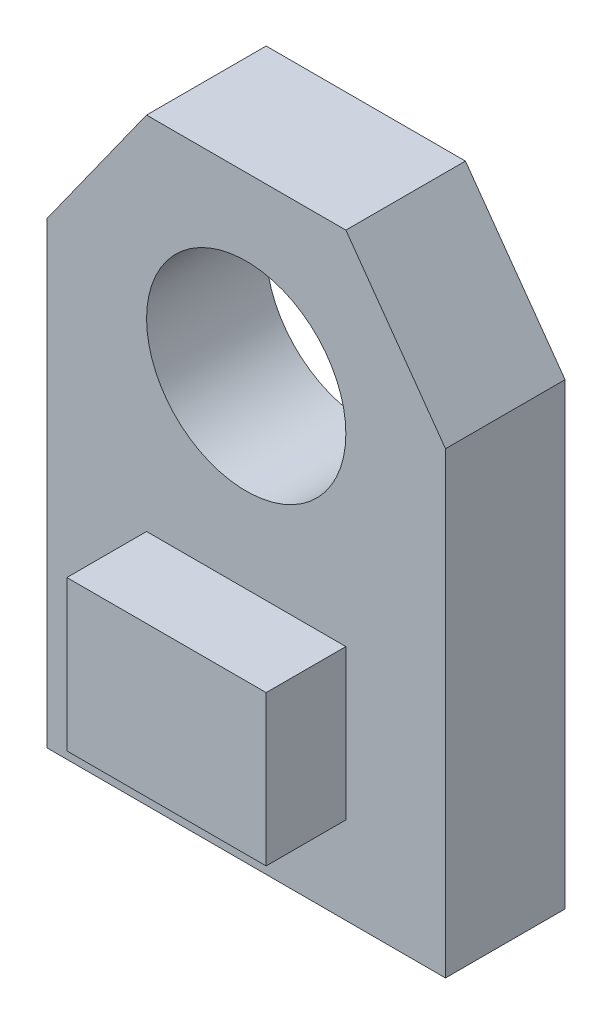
ISO-10303-21;
HEADER;
FILE_DESCRIPTION(('STEP AP214'),'2;1');
FILE_NAME('part.step','',(''),(''),'','','');
FILE_SCHEMA(('AUTOMOTIVE_DESIGN { 1 0 10303 214 1 1 1 1 }'));
ENDSEC;
DATA;
#1=APPLICATION_CONTEXT('core data for automotive mechanical design processes');
#2=APPLICATION_PROTOCOL_DEFINITION('international standard','automotive_design',2000,#1);
#3=PRODUCT_CONTEXT('',#1,'mechanical');
#4=PRODUCT('Part','Part','',(#3));
#5=PRODUCT_RELATED_PRODUCT_CATEGORY('part','',(#4));
#6=PRODUCT_DEFINITION_FORMATION('','',#4);
#7=PRODUCT_DEFINITION_CONTEXT('part definition',#1,'design');
#8=PRODUCT_DEFINITION('design','',#6,#7);
#9=PRODUCT_DEFINITION_SHAPE('','',#8);
#10=(LENGTH_UNIT() NAMED_UNIT(*) SI_UNIT(.MILLI.,.METRE.));
#11=(NAMED_UNIT(*) PLANE_ANGLE_UNIT() SI_UNIT($,.RADIAN.));
#12=(NAMED_UNIT(*) SI_UNIT($,.STERADIAN.) SOLID_ANGLE_UNIT());
#13=UNCERTAINTY_MEASURE_WITH_UNIT(LENGTH_MEASURE(1.E-05),#10,'distance_accuracy_value','');
#14=(GEOMETRIC_REPRESENTATION_CONTEXT(3) GLOBAL_UNCERTAINTY_ASSIGNED_CONTEXT((#13)) GLOBAL_UNIT_ASSIGNED_CONTEXT((#10,
#11,#12)) REPRESENTATION_CONTEXT('',''));
#15=CARTESIAN_POINT('',(0.,0.,0.));
#16=DIRECTION('',(0.,0.,1.));
#17=DIRECTION('',(1.,0.,0.));
#18=AXIS2_PLACEMENT_3D('',#15,#16,#17);
#19=CARTESIAN_POINT('',(0.,74.,12.));
#20=DIRECTION('',(0.,0.,1.));
#21=DIRECTION('',(1.,0.,0.));
#22=AXIS2_PLACEMENT_3D('',#19,#20,#21);
#23=PLANE('',#22);
#24=DIRECTION('',(-0.581238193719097,-0.813733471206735,0.));
#25=VECTOR('',#24,1.);
#26=CARTESIAN_POINT('',(-10.,60.,12.));
#27=LINE('',#26,#25);
#28=CARTESIAN_POINT('',(-10.,60.,12.));
#29=VERTEX_POINT('',#28);
#30=CARTESIAN_POINT('',(-20.,46.,12.));
#31=VERTEX_POINT('',#30);
#32=EDGE_CURVE('E140',#29,#31,#27,.T.);
#33=ORIENTED_EDGE('',*,*,#32,.T.);
#34=DIRECTION('',(0.,-1.,0.));
#35=VECTOR('',#34,1.);
#36=CARTESIAN_POINT('',(-20.,46.,12.));
#37=LINE('',#36,#35);
#38=CARTESIAN_POINT('',(-20.,0.,12.));
#39=VERTEX_POINT('',#38);
#40=EDGE_CURVE('E91',#31,#39,#37,.T.);
#41=ORIENTED_EDGE('',*,*,#40,.T.);
#42=DIRECTION('',(1.,0.,0.));
#43=VECTOR('',#42,1.);
#44=CARTESIAN_POINT('',(-20.,0.,12.));
#45=LINE('',#44,#43);
#46=CARTESIAN_POINT('',(20.,0.,12.));
#47=VERTEX_POINT('',#46);
#48=EDGE_CURVE('E108',#39,#47,#45,.T.);
#49=ORIENTED_EDGE('',*,*,#48,.T.);
#50=DIRECTION('',(0.,1.,0.));
#51=VECTOR('',#50,1.);
#52=CARTESIAN_POINT('',(20.,46.,12.));
#53=LINE('',#52,#51);
#54=CARTESIAN_POINT('',(20.,46.,12.));
#55=VERTEX_POINT('',#54);
#56=EDGE_CURVE('E101',#47,#55,#53,.T.);
#57=ORIENTED_EDGE('',*,*,#56,.T.);
#58=DIRECTION('',(-0.581238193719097,0.813733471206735,0.));
#59=VECTOR('',#58,1.);
#60=CARTESIAN_POINT('',(10.,60.,12.));
#61=LINE('',#60,#59);
#62=CARTESIAN_POINT('',(10.,60.,12.));
#63=VERTEX_POINT('',#62);
#64=EDGE_CURVE('E105',#55,#63,#61,.T.);
#65=ORIENTED_EDGE('',*,*,#64,.T.);
#66=DIRECTION('',(-1.,0.,0.));
#67=VECTOR('',#66,1.);
#68=CARTESIAN_POINT('',(10.,60.,12.));
#69=LINE('',#68,#67);
#70=EDGE_CURVE('E56',#63,#29,#69,.T.);
#71=ORIENTED_EDGE('',*,*,#70,.T.);
#72=EDGE_LOOP('',(#33,#41,#49,#57,#65,#71));
#73=FACE_BOUND('',#72,.T.);
#74=CARTESIAN_POINT('',(0.,42.3114607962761,12.));
#75=DIRECTION('',(0.,0.,1.));
#76=DIRECTION('',(1.,0.,0.));
#77=AXIS2_PLACEMENT_3D('',#74,#75,#76);
#78=CIRCLE('',#77,10.);
#79=CARTESIAN_POINT('',(10.,42.3114607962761,12.));
#80=VERTEX_POINT('',#79);
#81=EDGE_CURVE('E158',#80,#80,#78,.T.);
#82=ORIENTED_EDGE('',*,*,#81,.F.);
#83=EDGE_LOOP('',(#82));
#84=FACE_BOUND('',#83,.T.);
#85=DIRECTION('',(-1.,0.,0.));
#86=VECTOR('',#85,1.);
#87=CARTESIAN_POINT('',(-10.,23.8052365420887,12.));
#88=LINE('',#87,#86);
#89=CARTESIAN_POINT('',(10.,23.8052365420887,12.));
#90=VERTEX_POINT('',#89);
#91=CARTESIAN_POINT('',(-10.,23.8052365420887,12.));
#92=VERTEX_POINT('',#91);
#93=EDGE_CURVE('E177',#90,#92,#88,.T.);
#94=ORIENTED_EDGE('',*,*,#93,.F.);
#95=DIRECTION('',(0.,1.,0.));
#96=VECTOR('',#95,1.);
#97=CARTESIAN_POINT('',(10.,23.8052365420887,12.));
#98=LINE('',#97,#96);
#99=CARTESIAN_POINT('',(10.,8.73732717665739,12.));
#100=VERTEX_POINT('',#99);
#101=EDGE_CURVE('E180',#100,#90,#98,.T.);
#102=ORIENTED_EDGE('',*,*,#101,.F.);
#103=DIRECTION('',(1.,0.,0.));
#104=VECTOR('',#103,1.);
#105=CARTESIAN_POINT('',(10.,8.73732717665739,12.));
#106=LINE('',#105,#104);
#107=CARTESIAN_POINT('',(-10.,8.73732717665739,12.));
#108=VERTEX_POINT('',#107);
#109=EDGE_CURVE('E172',#108,#100,#106,.T.);
#110=ORIENTED_EDGE('',*,*,#109,.F.);
#111=DIRECTION('',(0.,-1.,0.));
#112=VECTOR('',#111,1.);
#113=CARTESIAN_POINT('',(-10.,23.8052365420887,12.));
#114=LINE('',#113,#112);
#115=EDGE_CURVE('E175',#92,#108,#114,.T.);
#116=ORIENTED_EDGE('',*,*,#115,.F.);
#117=EDGE_LOOP('',(#94,#102,#110,#116));
#118=FACE_BOUND('',#117,.T.);
#119=ADVANCED_FACE('F31',(#73,#84,#118),#23,.T.);
#120=CARTESIAN_POINT('',(-10.,60.,12.));
#121=DIRECTION('',(0.813733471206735,-0.581238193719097,0.));
#122=DIRECTION('',(0.581238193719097,0.813733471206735,0.));
#123=AXIS2_PLACEMENT_3D('',#120,#121,#122);
#124=PLANE('',#123);
#125=DIRECTION('',(-0.581238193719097,-0.813733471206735,0.));
#126=VECTOR('',#125,1.);
#127=CARTESIAN_POINT('',(-10.,60.,0.));
#128=LINE('',#127,#126);
#129=CARTESIAN_POINT('',(-10.,60.,0.));
#130=VERTEX_POINT('',#129);
#131=CARTESIAN_POINT('',(-20.,46.,0.));
#132=VERTEX_POINT('',#131);
#133=EDGE_CURVE('E129',#130,#132,#128,.T.);
#134=ORIENTED_EDGE('',*,*,#133,.T.);
#135=DIRECTION('',(0.,0.,-1.));
#136=VECTOR('',#135,1.);
#137=CARTESIAN_POINT('',(-20.,46.,12.));
#138=LINE('',#137,#136);
#139=EDGE_CURVE('E11',#31,#132,#138,.T.);
#140=ORIENTED_EDGE('',*,*,#139,.F.);
#141=ORIENTED_EDGE('',*,*,#32,.F.);
#142=DIRECTION('',(0.,0.,-1.));
#143=VECTOR('',#142,1.);
#144=CARTESIAN_POINT('',(-10.,60.,12.));
#145=LINE('',#144,#143);
#146=EDGE_CURVE('E125',#29,#130,#145,.T.);
#147=ORIENTED_EDGE('',*,*,#146,.T.);
#148=EDGE_LOOP('',(#134,#140,#141,#147));
#149=FACE_BOUND('',#148,.T.);
#150=ADVANCED_FACE('F33',(#149),#124,.F.);
#151=CARTESIAN_POINT('',(-20.,46.,12.));
#152=DIRECTION('',(1.,0.,0.));
#153=DIRECTION('',(0.,1.,0.));
#154=AXIS2_PLACEMENT_3D('',#151,#152,#153);
#155=PLANE('',#154);
#156=DIRECTION('',(0.,-1.,0.));
#157=VECTOR('',#156,1.);
#158=CARTESIAN_POINT('',(-20.,46.,0.));
#159=LINE('',#158,#157);
#160=CARTESIAN_POINT('',(-20.,0.,0.));
#161=VERTEX_POINT('',#160);
#162=EDGE_CURVE('E132',#132,#161,#159,.T.);
#163=ORIENTED_EDGE('',*,*,#162,.T.);
#164=DIRECTION('',(0.,0.,-1.));
#165=VECTOR('',#164,1.);
#166=CARTESIAN_POINT('',(-20.,0.,12.));
#167=LINE('',#166,#165);
#168=EDGE_CURVE('E40',#39,#161,#167,.T.);
#169=ORIENTED_EDGE('',*,*,#168,.F.);
#170=ORIENTED_EDGE('',*,*,#40,.F.);
#171=ORIENTED_EDGE('',*,*,#139,.T.);
#172=EDGE_LOOP('',(#163,#169,#170,#171));
#173=FACE_BOUND('',#172,.T.);
#174=ADVANCED_FACE('F229',(#173),#155,.F.);
#175=CARTESIAN_POINT('',(-20.,0.,12.));
#176=DIRECTION('',(0.,1.,0.));
#177=DIRECTION('',(0.,0.,1.));
#178=AXIS2_PLACEMENT_3D('',#175,#176,#177);
#179=PLANE('',#178);
#180=DIRECTION('',(1.,0.,0.));
#181=VECTOR('',#180,1.);
#182=CARTESIAN_POINT('',(-20.,0.,0.));
#183=LINE('',#182,#181);
#184=CARTESIAN_POINT('',(20.,0.,0.));
#185=VERTEX_POINT('',#184);
#186=EDGE_CURVE('E134',#161,#185,#183,.T.);
#187=ORIENTED_EDGE('',*,*,#186,.T.);
#188=DIRECTION('',(0.,0.,-1.));
#189=VECTOR('',#188,1.);
#190=CARTESIAN_POINT('',(20.,0.,12.));
#191=LINE('',#190,#189);
#192=EDGE_CURVE('E120',#47,#185,#191,.T.);
#193=ORIENTED_EDGE('',*,*,#192,.F.);
#194=ORIENTED_EDGE('',*,*,#48,.F.);
#195=ORIENTED_EDGE('',*,*,#168,.T.);
#196=EDGE_LOOP('',(#187,#193,#194,#195));
#197=FACE_BOUND('',#196,.T.);
#198=ADVANCED_FACE('F147',(#197),#179,.F.);
#199=CARTESIAN_POINT('',(20.,46.,12.));
#200=DIRECTION('',(-1.,0.,0.));
#201=DIRECTION('',(0.,-1.,0.));
#202=AXIS2_PLACEMENT_3D('',#199,#200,#201);
#203=PLANE('',#202);
#204=DIRECTION('',(0.,1.,0.));
#205=VECTOR('',#204,1.);
#206=CARTESIAN_POINT('',(20.,46.,0.));
#207=LINE('',#206,#205);
#208=CARTESIAN_POINT('',(20.,46.,0.));
#209=VERTEX_POINT('',#208);
#210=EDGE_CURVE('E117',#185,#209,#207,.T.);
#211=ORIENTED_EDGE('',*,*,#210,.T.);
#212=DIRECTION('',(0.,0.,-1.));
#213=VECTOR('',#212,1.);
#214=CARTESIAN_POINT('',(20.,46.,12.));
#215=LINE('',#214,#213);
#216=EDGE_CURVE('E114',#55,#209,#215,.T.);
#217=ORIENTED_EDGE('',*,*,#216,.F.);
#218=ORIENTED_EDGE('',*,*,#56,.F.);
#219=ORIENTED_EDGE('',*,*,#192,.T.);
#220=EDGE_LOOP('',(#211,#217,#218,#219));
#221=FACE_BOUND('',#220,.T.);
#222=ADVANCED_FACE('F115',(#221),#203,.F.);
#223=CARTESIAN_POINT('',(10.,60.,12.));
#224=DIRECTION('',(-0.813733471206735,-0.581238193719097,0.));
#225=DIRECTION('',(0.581238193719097,-0.813733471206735,0.));
#226=AXIS2_PLACEMENT_3D('',#223,#224,#225);
#227=PLANE('',#226);
#228=DIRECTION('',(-0.581238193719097,0.813733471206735,0.));
#229=VECTOR('',#228,1.);
#230=CARTESIAN_POINT('',(10.,60.,0.));
#231=LINE('',#230,#229);
#232=CARTESIAN_POINT('',(10.,60.,0.));
#233=VERTEX_POINT('',#232);
#234=EDGE_CURVE('E137',#209,#233,#231,.T.);
#235=ORIENTED_EDGE('',*,*,#234,.T.);
#236=DIRECTION('',(0.,0.,-1.));
#237=VECTOR('',#236,1.);
#238=CARTESIAN_POINT('',(10.,60.,12.));
#239=LINE('',#238,#237);
#240=EDGE_CURVE('E121',#63,#233,#239,.T.);
#241=ORIENTED_EDGE('',*,*,#240,.F.);
#242=ORIENTED_EDGE('',*,*,#64,.F.);
#243=ORIENTED_EDGE('',*,*,#216,.T.);
#244=EDGE_LOOP('',(#235,#241,#242,#243));
#245=FACE_BOUND('',#244,.T.);
#246=ADVANCED_FACE('F123',(#245),#227,.F.);
#247=CARTESIAN_POINT('',(10.,60.,12.));
#248=DIRECTION('',(0.,-1.,0.));
#249=DIRECTION('',(0.,0.,-1.));
#250=AXIS2_PLACEMENT_3D('',#247,#248,#249);
#251=PLANE('',#250);
#252=DIRECTION('',(-1.,0.,0.));
#253=VECTOR('',#252,1.);
#254=CARTESIAN_POINT('',(10.,60.,0.));
#255=LINE('',#254,#253);
#256=EDGE_CURVE('E83',#233,#130,#255,.T.);
#257=ORIENTED_EDGE('',*,*,#256,.T.);
#258=ORIENTED_EDGE('',*,*,#146,.F.);
#259=ORIENTED_EDGE('',*,*,#70,.F.);
#260=ORIENTED_EDGE('',*,*,#240,.T.);
#261=EDGE_LOOP('',(#257,#258,#259,#260));
#262=FACE_BOUND('',#261,.T.);
#263=ADVANCED_FACE('F151',(#262),#251,.F.);
#264=CARTESIAN_POINT('',(0.,74.,0.));
#265=DIRECTION('',(0.,0.,1.));
#266=DIRECTION('',(1.,0.,0.));
#267=AXIS2_PLACEMENT_3D('',#264,#265,#266);
#268=PLANE('',#267);
#269=CARTESIAN_POINT('',(0.,42.3114607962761,0.));
#270=DIRECTION('',(0.,0.,1.));
#271=DIRECTION('',(1.,0.,0.));
#272=AXIS2_PLACEMENT_3D('',#269,#270,#271);
#273=CIRCLE('',#272,10.);
#274=CARTESIAN_POINT('',(10.,42.3114607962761,0.));
#275=VERTEX_POINT('',#274);
#276=EDGE_CURVE('E35',#275,#275,#273,.T.);
#277=ORIENTED_EDGE('',*,*,#276,.T.);
#278=EDGE_LOOP('',(#277));
#279=FACE_BOUND('',#278,.T.);
#280=ORIENTED_EDGE('',*,*,#133,.F.);
#281=ORIENTED_EDGE('',*,*,#256,.F.);
#282=ORIENTED_EDGE('',*,*,#234,.F.);
#283=ORIENTED_EDGE('',*,*,#210,.F.);
#284=ORIENTED_EDGE('',*,*,#186,.F.);
#285=ORIENTED_EDGE('',*,*,#162,.F.);
#286=EDGE_LOOP('',(#280,#281,#282,#283,#284,#285));
#287=FACE_BOUND('',#286,.T.);
#288=ADVANCED_FACE('F150',(#279,#287),#268,.F.);
#289=CARTESIAN_POINT('',(0.,42.3114607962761,-10.));
#290=DIRECTION('',(0.,0.,1.));
#291=DIRECTION('',(1.,0.,0.));
#292=AXIS2_PLACEMENT_3D('',#289,#290,#291);
#293=CYLINDRICAL_SURFACE('',#292,10.);
#294=ORIENTED_EDGE('',*,*,#81,.T.);
#295=EDGE_LOOP('',(#294));
#296=FACE_BOUND('',#295,.T.);
#297=ORIENTED_EDGE('',*,*,#276,.F.);
#298=EDGE_LOOP('',(#297));
#299=FACE_BOUND('',#298,.T.);
#300=ADVANCED_FACE('F232',(#296,#299),#293,.F.);
#301=CARTESIAN_POINT('',(10.,23.8052365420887,20.));
#302=DIRECTION('',(-1.,0.,0.));
#303=DIRECTION('',(0.,0.,1.));
#304=AXIS2_PLACEMENT_3D('',#301,#302,#303);
#305=PLANE('',#304);
#306=ORIENTED_EDGE('',*,*,#101,.T.);
#307=DIRECTION('',(0.,0.,-1.));
#308=VECTOR('',#307,1.);
#309=CARTESIAN_POINT('',(10.,23.8052365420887,20.));
#310=LINE('',#309,#308);
#311=CARTESIAN_POINT('',(10.,23.8052365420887,20.));
#312=VERTEX_POINT('',#311);
#313=EDGE_CURVE('E161',#312,#90,#310,.T.);
#314=ORIENTED_EDGE('',*,*,#313,.F.);
#315=DIRECTION('',(0.,1.,0.));
#316=VECTOR('',#315,1.);
#317=CARTESIAN_POINT('',(10.,23.8052365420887,20.));
#318=LINE('',#317,#316);
#319=CARTESIAN_POINT('',(10.,8.73732717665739,20.));
#320=VERTEX_POINT('',#319);
#321=EDGE_CURVE('E174',#320,#312,#318,.T.);
#322=ORIENTED_EDGE('',*,*,#321,.F.);
#323=DIRECTION('',(0.,0.,-1.));
#324=VECTOR('',#323,1.);
#325=CARTESIAN_POINT('',(10.,8.73732717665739,20.));
#326=LINE('',#325,#324);
#327=EDGE_CURVE('E168',#320,#100,#326,.T.);
#328=ORIENTED_EDGE('',*,*,#327,.T.);
#329=EDGE_LOOP('',(#306,#314,#322,#328));
#330=FACE_BOUND('',#329,.T.);
#331=ADVANCED_FACE('F203',(#330),#305,.F.);
#332=CARTESIAN_POINT('',(-10.,23.8052365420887,20.));
#333=DIRECTION('',(0.,-1.,0.));
#334=DIRECTION('',(0.,0.,-1.));
#335=AXIS2_PLACEMENT_3D('',#332,#333,#334);
#336=PLANE('',#335);
#337=ORIENTED_EDGE('',*,*,#93,.T.);
#338=DIRECTION('',(0.,0.,-1.));
#339=VECTOR('',#338,1.);
#340=CARTESIAN_POINT('',(-10.,23.8052365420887,20.));
#341=LINE('',#340,#339);
#342=CARTESIAN_POINT('',(-10.,23.8052365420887,20.));
#343=VERTEX_POINT('',#342);
#344=EDGE_CURVE('E164',#343,#92,#341,.T.);
#345=ORIENTED_EDGE('',*,*,#344,.F.);
#346=DIRECTION('',(-1.,0.,0.));
#347=VECTOR('',#346,1.);
#348=CARTESIAN_POINT('',(-10.,23.8052365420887,20.));
#349=LINE('',#348,#347);
#350=EDGE_CURVE('E188',#312,#343,#349,.T.);
#351=ORIENTED_EDGE('',*,*,#350,.F.);
#352=ORIENTED_EDGE('',*,*,#313,.T.);
#353=EDGE_LOOP('',(#337,#345,#351,#352));
#354=FACE_BOUND('',#353,.T.);
#355=ADVANCED_FACE('F208',(#354),#336,.F.);
#356=CARTESIAN_POINT('',(-10.,23.8052365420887,20.));
#357=DIRECTION('',(1.,0.,0.));
#358=DIRECTION('',(0.,0.,-1.));
#359=AXIS2_PLACEMENT_3D('',#356,#357,#358);
#360=PLANE('',#359);
#361=ORIENTED_EDGE('',*,*,#115,.T.);
#362=DIRECTION('',(0.,0.,-1.));
#363=VECTOR('',#362,1.);
#364=CARTESIAN_POINT('',(-10.,8.73732717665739,20.));
#365=LINE('',#364,#363);
#366=CARTESIAN_POINT('',(-10.,8.73732717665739,20.));
#367=VERTEX_POINT('',#366);
#368=EDGE_CURVE('E47',#367,#108,#365,.T.);
#369=ORIENTED_EDGE('',*,*,#368,.F.);
#370=DIRECTION('',(0.,-1.,0.));
#371=VECTOR('',#370,1.);
#372=CARTESIAN_POINT('',(-10.,23.8052365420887,20.));
#373=LINE('',#372,#371);
#374=EDGE_CURVE('E185',#343,#367,#373,.T.);
#375=ORIENTED_EDGE('',*,*,#374,.F.);
#376=ORIENTED_EDGE('',*,*,#344,.T.);
#377=EDGE_LOOP('',(#361,#369,#375,#376));
#378=FACE_BOUND('',#377,.T.);
#379=ADVANCED_FACE('F217',(#378),#360,.F.);
#380=CARTESIAN_POINT('',(10.,8.73732717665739,20.));
#381=DIRECTION('',(0.,1.,0.));
#382=DIRECTION('',(0.,0.,1.));
#383=AXIS2_PLACEMENT_3D('',#380,#381,#382);
#384=PLANE('',#383);
#385=ORIENTED_EDGE('',*,*,#109,.T.);
#386=ORIENTED_EDGE('',*,*,#327,.F.);
#387=DIRECTION('',(1.,0.,0.));
#388=VECTOR('',#387,1.);
#389=CARTESIAN_POINT('',(10.,8.73732717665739,20.));
#390=LINE('',#389,#388);
#391=EDGE_CURVE('E171',#367,#320,#390,.T.);
#392=ORIENTED_EDGE('',*,*,#391,.F.);
#393=ORIENTED_EDGE('',*,*,#368,.T.);
#394=EDGE_LOOP('',(#385,#386,#392,#393));
#395=FACE_BOUND('',#394,.T.);
#396=ADVANCED_FACE('F220',(#395),#384,.F.);
#397=CARTESIAN_POINT('',(10.,8.73732717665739,20.));
#398=DIRECTION('',(0.,0.,-1.));
#399=DIRECTION('',(-1.,0.,0.));
#400=AXIS2_PLACEMENT_3D('',#397,#398,#399);
#401=PLANE('',#400);
#402=ORIENTED_EDGE('',*,*,#321,.T.);
#403=ORIENTED_EDGE('',*,*,#350,.T.);
#404=ORIENTED_EDGE('',*,*,#374,.T.);
#405=ORIENTED_EDGE('',*,*,#391,.T.);
#406=EDGE_LOOP('',(#402,#403,#404,#405));
#407=FACE_BOUND('',#406,.T.);
#408=ADVANCED_FACE('F196',(#407),#401,.F.);
#409=CLOSED_SHELL('',(#119,#150,#174,#198,#222,#246,#263,#288,#300,#331,#355,#379,#396,#408));
#410=MANIFOLD_SOLID_BREP('B2',#409);
#411=ADVANCED_BREP_SHAPE_REPRESENTATION('',(#18,#410),#14);
#412=SHAPE_DEFINITION_REPRESENTATION(#9,#411);
ENDSEC;
END-ISO-10303-21;
